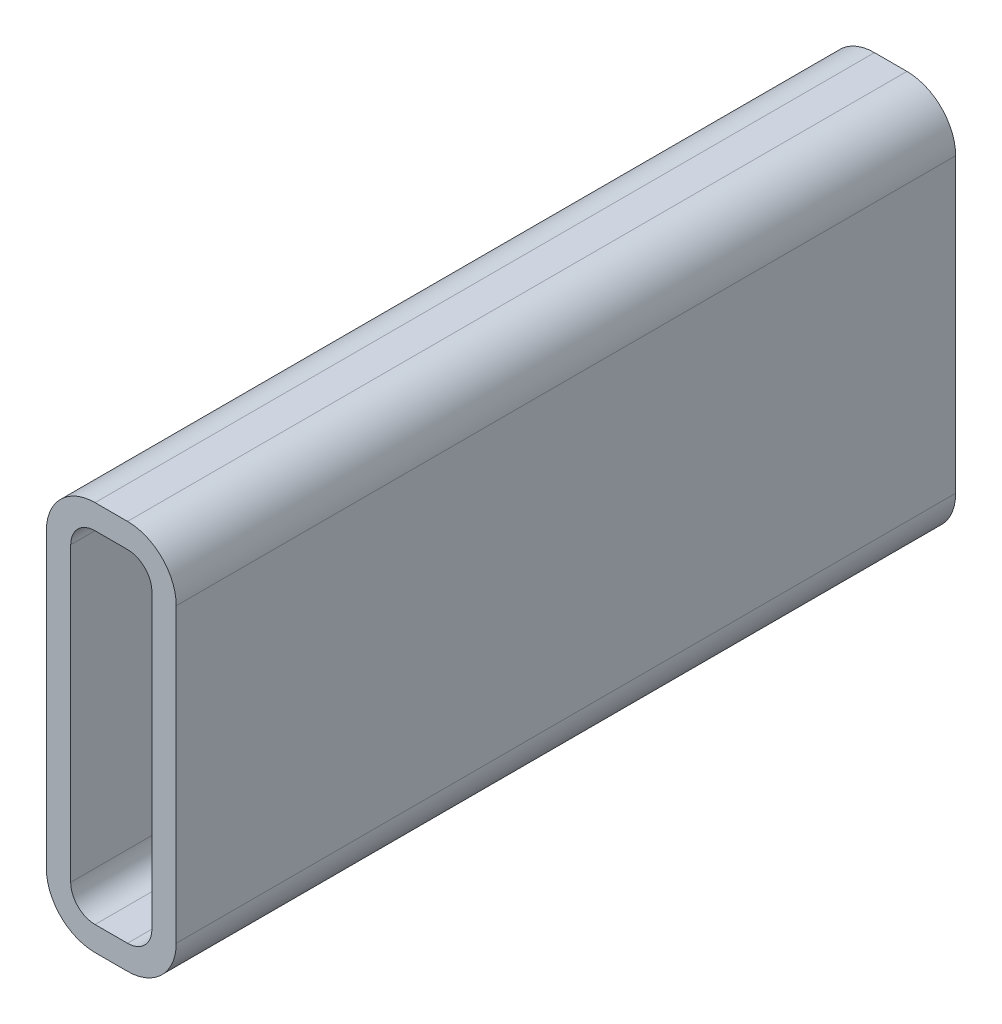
from build123d import *

# Parameters (mm, degrees)
BOSS_EXTRUDE1_DEPTH = 304.8


with BuildPart() as part:
    # Sketch1 → Boss-Extrude1 (new body)
    with BuildSketch(Plane.XY):
        with BuildLine():
            Line((19.05, 152.4), (31.75, 152.4))
            ThreePointArc((31.75, 152.4), (45.220384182, 146.820384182), (50.8, 133.35))
            Line((50.8, 133.35), (50.8, 19.05))
            ThreePointArc((50.8, 19.05), (45.220384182, 5.579615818), (31.75, 0))
            Line((31.75, 0), (19.05, 0))
            ThreePointArc((19.05, 0), (5.579615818, 5.579615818), (0, 19.05))
            Line((0, 19.05), (0, 133.35))
            ThreePointArc((0, 133.35), (5.579615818, 146.820384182), (19.05, 152.4))
        make_face()
        with BuildLine():
            Line((19.05, 142.875), (31.75, 142.875))
            ThreePointArc((31.75, 142.875), (38.485192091, 140.085192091), (41.275, 133.35))
            Line((41.275, 133.35), (41.275, 19.05))
            ThreePointArc((41.275, 19.05), (38.485192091, 12.314807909), (31.75, 9.525))
            Line((31.75, 9.525), (19.05, 9.525))
            ThreePointArc((19.05, 9.525), (12.314807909, 12.314807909), (9.525, 19.05))
            Line((9.525, 19.05), (9.525, 133.35))
            ThreePointArc((9.525, 133.35), (12.314807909, 140.085192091), (19.05, 142.875))
        make_face(mode=Mode.SUBTRACT)
    extrude(amount=BOSS_EXTRUDE1_DEPTH)


solid = part.part
